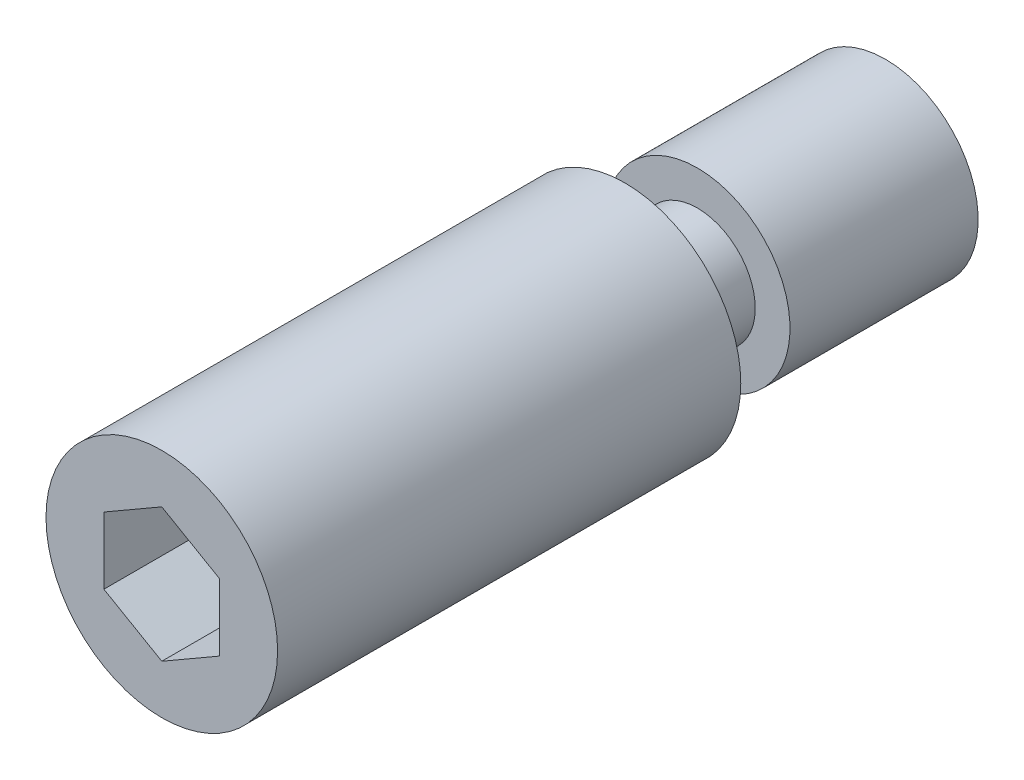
ISO-10303-21;
HEADER;
FILE_DESCRIPTION(('STEP AP214'),'2;1');
FILE_NAME('part.step','',(''),(''),'','','');
FILE_SCHEMA(('AUTOMOTIVE_DESIGN { 1 0 10303 214 1 1 1 1 }'));
ENDSEC;
DATA;
#1=APPLICATION_CONTEXT('core data for automotive mechanical design processes');
#2=APPLICATION_PROTOCOL_DEFINITION('international standard','automotive_design',2000,#1);
#3=PRODUCT_CONTEXT('',#1,'mechanical');
#4=PRODUCT('Part','Part','',(#3));
#5=PRODUCT_RELATED_PRODUCT_CATEGORY('part','',(#4));
#6=PRODUCT_DEFINITION_FORMATION('','',#4);
#7=PRODUCT_DEFINITION_CONTEXT('part definition',#1,'design');
#8=PRODUCT_DEFINITION('design','',#6,#7);
#9=PRODUCT_DEFINITION_SHAPE('','',#8);
#10=(LENGTH_UNIT() NAMED_UNIT(*) SI_UNIT(.MILLI.,.METRE.));
#11=(NAMED_UNIT(*) PLANE_ANGLE_UNIT() SI_UNIT($,.RADIAN.));
#12=(NAMED_UNIT(*) SI_UNIT($,.STERADIAN.) SOLID_ANGLE_UNIT());
#13=UNCERTAINTY_MEASURE_WITH_UNIT(LENGTH_MEASURE(1.E-05),#10,'distance_accuracy_value','');
#14=(GEOMETRIC_REPRESENTATION_CONTEXT(3) GLOBAL_UNCERTAINTY_ASSIGNED_CONTEXT((#13)) GLOBAL_UNIT_ASSIGNED_CONTEXT((#10,
#11,#12)) REPRESENTATION_CONTEXT('',''));
#15=CARTESIAN_POINT('',(0.,0.,0.));
#16=DIRECTION('',(0.,0.,1.));
#17=DIRECTION('',(1.,0.,0.));
#18=AXIS2_PLACEMENT_3D('',#15,#16,#17);
#19=CARTESIAN_POINT('',(0.,-4.,9.));
#20=DIRECTION('',(0.,0.,-1.));
#21=DIRECTION('',(0.,-1.,0.));
#22=AXIS2_PLACEMENT_3D('',#19,#20,#21);
#23=PLANE('',#22);
#24=CARTESIAN_POINT('',(0.,0.,9.));
#25=DIRECTION('',(0.,0.,1.));
#26=DIRECTION('',(0.,1.,0.));
#27=AXIS2_PLACEMENT_3D('',#24,#25,#26);
#28=CIRCLE('',#27,2.);
#29=CARTESIAN_POINT('',(0.,2.,9.));
#30=VERTEX_POINT('',#29);
#31=EDGE_CURVE('E115',#30,#30,#28,.T.);
#32=ORIENTED_EDGE('',*,*,#31,.T.);
#33=EDGE_LOOP('',(#32));
#34=FACE_BOUND('',#33,.T.);
#35=CARTESIAN_POINT('',(0.,0.,9.));
#36=DIRECTION('',(0.,0.,1.));
#37=DIRECTION('',(0.,1.,0.));
#38=AXIS2_PLACEMENT_3D('',#35,#36,#37);
#39=CIRCLE('',#38,4.);
#40=CARTESIAN_POINT('',(0.,4.,9.));
#41=VERTEX_POINT('',#40);
#42=EDGE_CURVE('E9',#41,#41,#39,.T.);
#43=ORIENTED_EDGE('',*,*,#42,.F.);
#44=EDGE_LOOP('',(#43));
#45=FACE_BOUND('',#44,.T.);
#46=ADVANCED_FACE('F14',(#34,#45),#23,.T.);
#47=CARTESIAN_POINT('',(0.,0.,20.));
#48=DIRECTION('',(0.,0.,1.));
#49=DIRECTION('',(0.,1.,0.));
#50=AXIS2_PLACEMENT_3D('',#47,#48,#49);
#51=CYLINDRICAL_SURFACE('',#50,4.);
#52=CARTESIAN_POINT('',(0.,0.,25.));
#53=DIRECTION('',(0.,0.,1.));
#54=DIRECTION('',(0.,1.,0.));
#55=AXIS2_PLACEMENT_3D('',#52,#53,#54);
#56=CIRCLE('',#55,4.);
#57=CARTESIAN_POINT('',(0.,4.,25.));
#58=VERTEX_POINT('',#57);
#59=EDGE_CURVE('E21',#58,#58,#56,.T.);
#60=ORIENTED_EDGE('',*,*,#59,.F.);
#61=EDGE_LOOP('',(#60));
#62=FACE_BOUND('',#61,.T.);
#63=ORIENTED_EDGE('',*,*,#42,.T.);
#64=EDGE_LOOP('',(#63));
#65=FACE_BOUND('',#64,.T.);
#66=ADVANCED_FACE('F136',(#62,#65),#51,.T.);
#67=CARTESIAN_POINT('',(0.,-4.,25.));
#68=DIRECTION('',(0.,0.,-1.));
#69=DIRECTION('',(0.,-1.,0.));
#70=AXIS2_PLACEMENT_3D('',#67,#68,#69);
#71=PLANE('',#70);
#72=DIRECTION('',(-0.866025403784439,-0.5,0.));
#73=VECTOR('',#72,1.);
#74=CARTESIAN_POINT('',(0.,2.30940107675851,25.));
#75=LINE('',#74,#73);
#76=CARTESIAN_POINT('',(0.,2.30940107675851,25.));
#77=VERTEX_POINT('',#76);
#78=CARTESIAN_POINT('',(-2.,1.15470053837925,25.));
#79=VERTEX_POINT('',#78);
#80=EDGE_CURVE('E102',#77,#79,#75,.T.);
#81=ORIENTED_EDGE('',*,*,#80,.F.);
#82=DIRECTION('',(-0.866025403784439,0.5,0.));
#83=VECTOR('',#82,1.);
#84=CARTESIAN_POINT('',(2.,1.15470053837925,25.));
#85=LINE('',#84,#83);
#86=CARTESIAN_POINT('',(2.,1.15470053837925,25.));
#87=VERTEX_POINT('',#86);
#88=EDGE_CURVE('E28',#87,#77,#85,.T.);
#89=ORIENTED_EDGE('',*,*,#88,.F.);
#90=DIRECTION('',(0.,1.,0.));
#91=VECTOR('',#90,1.);
#92=CARTESIAN_POINT('',(2.,-1.15470053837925,25.));
#93=LINE('',#92,#91);
#94=CARTESIAN_POINT('',(2.,-1.15470053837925,25.));
#95=VERTEX_POINT('',#94);
#96=EDGE_CURVE('E111',#95,#87,#93,.T.);
#97=ORIENTED_EDGE('',*,*,#96,.F.);
#98=DIRECTION('',(0.866025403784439,0.5,0.));
#99=VECTOR('',#98,1.);
#100=CARTESIAN_POINT('',(0.,-2.30940107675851,25.));
#101=LINE('',#100,#99);
#102=CARTESIAN_POINT('',(0.,-2.30940107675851,25.));
#103=VERTEX_POINT('',#102);
#104=EDGE_CURVE('E109',#103,#95,#101,.T.);
#105=ORIENTED_EDGE('',*,*,#104,.F.);
#106=DIRECTION('',(0.866025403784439,-0.5,0.));
#107=VECTOR('',#106,1.);
#108=CARTESIAN_POINT('',(-2.,-1.15470053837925,25.));
#109=LINE('',#108,#107);
#110=CARTESIAN_POINT('',(-2.,-1.15470053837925,25.));
#111=VERTEX_POINT('',#110);
#112=EDGE_CURVE('E76',#111,#103,#109,.T.);
#113=ORIENTED_EDGE('',*,*,#112,.F.);
#114=DIRECTION('',(0.,-1.,0.));
#115=VECTOR('',#114,1.);
#116=CARTESIAN_POINT('',(-2.,1.15470053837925,25.));
#117=LINE('',#116,#115);
#118=EDGE_CURVE('E105',#79,#111,#117,.T.);
#119=ORIENTED_EDGE('',*,*,#118,.F.);
#120=EDGE_LOOP('',(#81,#89,#97,#105,#113,#119));
#121=FACE_BOUND('',#120,.T.);
#122=ORIENTED_EDGE('',*,*,#59,.T.);
#123=EDGE_LOOP('',(#122));
#124=FACE_BOUND('',#123,.T.);
#125=ADVANCED_FACE('F134',(#121,#124),#71,.F.);
#126=CARTESIAN_POINT('',(0.,-3.2,0.));
#127=DIRECTION('',(0.,0.,-1.));
#128=DIRECTION('',(0.,-1.,0.));
#129=AXIS2_PLACEMENT_3D('',#126,#127,#128);
#130=PLANE('',#129);
#131=CARTESIAN_POINT('',(0.,0.,0.));
#132=DIRECTION('',(0.,0.,1.));
#133=DIRECTION('',(0.,1.,0.));
#134=AXIS2_PLACEMENT_3D('',#131,#132,#133);
#135=CIRCLE('',#134,3.2);
#136=CARTESIAN_POINT('',(0.,3.2,0.));
#137=VERTEX_POINT('',#136);
#138=EDGE_CURVE('E129',#137,#137,#135,.T.);
#139=ORIENTED_EDGE('',*,*,#138,.F.);
#140=EDGE_LOOP('',(#139));
#141=FACE_BOUND('',#140,.T.);
#142=ADVANCED_FACE('F167',(#141),#130,.T.);
#143=CARTESIAN_POINT('',(0.,0.,20.));
#144=DIRECTION('',(0.,0.,1.));
#145=DIRECTION('',(0.,1.,0.));
#146=AXIS2_PLACEMENT_3D('',#143,#144,#145);
#147=CYLINDRICAL_SURFACE('',#146,3.2);
#148=ORIENTED_EDGE('',*,*,#138,.T.);
#149=EDGE_LOOP('',(#148));
#150=FACE_BOUND('',#149,.T.);
#151=CARTESIAN_POINT('',(0.,0.,6.5));
#152=DIRECTION('',(0.,0.,1.));
#153=DIRECTION('',(0.,1.,0.));
#154=AXIS2_PLACEMENT_3D('',#151,#152,#153);
#155=CIRCLE('',#154,3.2);
#156=CARTESIAN_POINT('',(0.,3.2,6.5));
#157=VERTEX_POINT('',#156);
#158=EDGE_CURVE('E126',#157,#157,#155,.T.);
#159=ORIENTED_EDGE('',*,*,#158,.F.);
#160=EDGE_LOOP('',(#159));
#161=FACE_BOUND('',#160,.T.);
#162=ADVANCED_FACE('F160',(#150,#161),#147,.T.);
#163=CARTESIAN_POINT('',(0.,-2.,6.5));
#164=DIRECTION('',(0.,0.,1.));
#165=DIRECTION('',(0.,1.,0.));
#166=AXIS2_PLACEMENT_3D('',#163,#164,#165);
#167=PLANE('',#166);
#168=ORIENTED_EDGE('',*,*,#158,.T.);
#169=EDGE_LOOP('',(#168));
#170=FACE_BOUND('',#169,.T.);
#171=CARTESIAN_POINT('',(0.,0.,6.5));
#172=DIRECTION('',(0.,0.,1.));
#173=DIRECTION('',(0.,1.,0.));
#174=AXIS2_PLACEMENT_3D('',#171,#172,#173);
#175=CIRCLE('',#174,2.);
#176=CARTESIAN_POINT('',(0.,2.,6.5));
#177=VERTEX_POINT('',#176);
#178=EDGE_CURVE('E123',#177,#177,#175,.T.);
#179=ORIENTED_EDGE('',*,*,#178,.F.);
#180=EDGE_LOOP('',(#179));
#181=FACE_BOUND('',#180,.T.);
#182=ADVANCED_FACE('F151',(#170,#181),#167,.T.);
#183=CARTESIAN_POINT('',(0.,0.,20.));
#184=DIRECTION('',(0.,0.,1.));
#185=DIRECTION('',(0.,1.,0.));
#186=AXIS2_PLACEMENT_3D('',#183,#184,#185);
#187=CYLINDRICAL_SURFACE('',#186,2.);
#188=ORIENTED_EDGE('',*,*,#178,.T.);
#189=EDGE_LOOP('',(#188));
#190=FACE_BOUND('',#189,.T.);
#191=ORIENTED_EDGE('',*,*,#31,.F.);
#192=EDGE_LOOP('',(#191));
#193=FACE_BOUND('',#192,.T.);
#194=ADVANCED_FACE('F148',(#190,#193),#187,.T.);
#195=CARTESIAN_POINT('',(2.,1.15470053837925,20.));
#196=DIRECTION('',(0.5,0.866025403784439,0.));
#197=DIRECTION('',(-0.866025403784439,0.5,0.));
#198=AXIS2_PLACEMENT_3D('',#195,#196,#197);
#199=PLANE('',#198);
#200=ORIENTED_EDGE('',*,*,#88,.T.);
#201=DIRECTION('',(0.,0.,1.));
#202=VECTOR('',#201,1.);
#203=CARTESIAN_POINT('',(0.,2.30940107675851,20.));
#204=LINE('',#203,#202);
#205=CARTESIAN_POINT('',(0.,2.30940107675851,20.));
#206=VERTEX_POINT('',#205);
#207=EDGE_CURVE('E58',#206,#77,#204,.T.);
#208=ORIENTED_EDGE('',*,*,#207,.F.);
#209=DIRECTION('',(-0.866025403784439,0.5,0.));
#210=VECTOR('',#209,1.);
#211=CARTESIAN_POINT('',(2.,1.15470053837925,20.));
#212=LINE('',#211,#210);
#213=CARTESIAN_POINT('',(2.,1.15470053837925,20.));
#214=VERTEX_POINT('',#213);
#215=EDGE_CURVE('E113',#214,#206,#212,.T.);
#216=ORIENTED_EDGE('',*,*,#215,.F.);
#217=DIRECTION('',(0.,0.,1.));
#218=VECTOR('',#217,1.);
#219=CARTESIAN_POINT('',(2.,1.15470053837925,20.));
#220=LINE('',#219,#218);
#221=EDGE_CURVE('E36',#214,#87,#220,.T.);
#222=ORIENTED_EDGE('',*,*,#221,.T.);
#223=EDGE_LOOP('',(#200,#208,#216,#222));
#224=FACE_BOUND('',#223,.T.);
#225=ADVANCED_FACE('F150',(#224),#199,.F.);
#226=CARTESIAN_POINT('',(2.,-1.15470053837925,20.));
#227=DIRECTION('',(1.,0.,0.));
#228=DIRECTION('',(0.,0.,-1.));
#229=AXIS2_PLACEMENT_3D('',#226,#227,#228);
#230=PLANE('',#229);
#231=ORIENTED_EDGE('',*,*,#96,.T.);
#232=ORIENTED_EDGE('',*,*,#221,.F.);
#233=DIRECTION('',(0.,1.,0.));
#234=VECTOR('',#233,1.);
#235=CARTESIAN_POINT('',(2.,-1.15470053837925,20.));
#236=LINE('',#235,#234);
#237=CARTESIAN_POINT('',(2.,-1.15470053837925,20.));
#238=VERTEX_POINT('',#237);
#239=EDGE_CURVE('E88',#238,#214,#236,.T.);
#240=ORIENTED_EDGE('',*,*,#239,.F.);
#241=DIRECTION('',(0.,0.,1.));
#242=VECTOR('',#241,1.);
#243=CARTESIAN_POINT('',(2.,-1.15470053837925,20.));
#244=LINE('',#243,#242);
#245=EDGE_CURVE('E80',#238,#95,#244,.T.);
#246=ORIENTED_EDGE('',*,*,#245,.T.);
#247=EDGE_LOOP('',(#231,#232,#240,#246));
#248=FACE_BOUND('',#247,.T.);
#249=ADVANCED_FACE('F158',(#248),#230,.F.);
#250=CARTESIAN_POINT('',(0.,-2.30940107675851,20.));
#251=DIRECTION('',(0.5,-0.866025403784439,0.));
#252=DIRECTION('',(0.866025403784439,0.5,0.));
#253=AXIS2_PLACEMENT_3D('',#250,#251,#252);
#254=PLANE('',#253);
#255=ORIENTED_EDGE('',*,*,#104,.T.);
#256=ORIENTED_EDGE('',*,*,#245,.F.);
#257=DIRECTION('',(0.866025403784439,0.5,0.));
#258=VECTOR('',#257,1.);
#259=CARTESIAN_POINT('',(0.,-2.30940107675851,20.));
#260=LINE('',#259,#258);
#261=CARTESIAN_POINT('',(0.,-2.30940107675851,20.));
#262=VERTEX_POINT('',#261);
#263=EDGE_CURVE('E84',#262,#238,#260,.T.);
#264=ORIENTED_EDGE('',*,*,#263,.F.);
#265=DIRECTION('',(0.,0.,1.));
#266=VECTOR('',#265,1.);
#267=CARTESIAN_POINT('',(0.,-2.30940107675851,20.));
#268=LINE('',#267,#266);
#269=EDGE_CURVE('E69',#262,#103,#268,.T.);
#270=ORIENTED_EDGE('',*,*,#269,.T.);
#271=EDGE_LOOP('',(#255,#256,#264,#270));
#272=FACE_BOUND('',#271,.T.);
#273=ADVANCED_FACE('F85',(#272),#254,.F.);
#274=CARTESIAN_POINT('',(-2.,-1.15470053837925,20.));
#275=DIRECTION('',(-0.5,-0.866025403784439,0.));
#276=DIRECTION('',(0.866025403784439,-0.5,0.));
#277=AXIS2_PLACEMENT_3D('',#274,#275,#276);
#278=PLANE('',#277);
#279=ORIENTED_EDGE('',*,*,#112,.T.);
#280=ORIENTED_EDGE('',*,*,#269,.F.);
#281=DIRECTION('',(0.866025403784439,-0.5,0.));
#282=VECTOR('',#281,1.);
#283=CARTESIAN_POINT('',(-2.,-1.15470053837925,20.));
#284=LINE('',#283,#282);
#285=CARTESIAN_POINT('',(-2.,-1.15470053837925,20.));
#286=VERTEX_POINT('',#285);
#287=EDGE_CURVE('E73',#286,#262,#284,.T.);
#288=ORIENTED_EDGE('',*,*,#287,.F.);
#289=DIRECTION('',(0.,0.,1.));
#290=VECTOR('',#289,1.);
#291=CARTESIAN_POINT('',(-2.,-1.15470053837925,20.));
#292=LINE('',#291,#290);
#293=EDGE_CURVE('E81',#286,#111,#292,.T.);
#294=ORIENTED_EDGE('',*,*,#293,.T.);
#295=EDGE_LOOP('',(#279,#280,#288,#294));
#296=FACE_BOUND('',#295,.T.);
#297=ADVANCED_FACE('F71',(#296),#278,.F.);
#298=CARTESIAN_POINT('',(-2.,1.15470053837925,20.));
#299=DIRECTION('',(-1.,0.,0.));
#300=DIRECTION('',(0.,-1.,0.));
#301=AXIS2_PLACEMENT_3D('',#298,#299,#300);
#302=PLANE('',#301);
#303=ORIENTED_EDGE('',*,*,#118,.T.);
#304=ORIENTED_EDGE('',*,*,#293,.F.);
#305=DIRECTION('',(0.,-1.,0.));
#306=VECTOR('',#305,1.);
#307=CARTESIAN_POINT('',(-2.,1.15470053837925,20.));
#308=LINE('',#307,#306);
#309=CARTESIAN_POINT('',(-2.,1.15470053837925,20.));
#310=VERTEX_POINT('',#309);
#311=EDGE_CURVE('E94',#310,#286,#308,.T.);
#312=ORIENTED_EDGE('',*,*,#311,.F.);
#313=DIRECTION('',(0.,0.,1.));
#314=VECTOR('',#313,1.);
#315=CARTESIAN_POINT('',(-2.,1.15470053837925,20.));
#316=LINE('',#315,#314);
#317=EDGE_CURVE('E118',#310,#79,#316,.T.);
#318=ORIENTED_EDGE('',*,*,#317,.T.);
#319=EDGE_LOOP('',(#303,#304,#312,#318));
#320=FACE_BOUND('',#319,.T.);
#321=ADVANCED_FACE('F192',(#320),#302,.F.);
#322=CARTESIAN_POINT('',(0.,2.30940107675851,20.));
#323=DIRECTION('',(-0.5,0.866025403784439,0.));
#324=DIRECTION('',(-0.866025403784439,-0.5,0.));
#325=AXIS2_PLACEMENT_3D('',#322,#323,#324);
#326=PLANE('',#325);
#327=ORIENTED_EDGE('',*,*,#80,.T.);
#328=ORIENTED_EDGE('',*,*,#317,.F.);
#329=DIRECTION('',(-0.866025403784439,-0.5,0.));
#330=VECTOR('',#329,1.);
#331=CARTESIAN_POINT('',(0.,2.30940107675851,20.));
#332=LINE('',#331,#330);
#333=EDGE_CURVE('E96',#206,#310,#332,.T.);
#334=ORIENTED_EDGE('',*,*,#333,.F.);
#335=ORIENTED_EDGE('',*,*,#207,.T.);
#336=EDGE_LOOP('',(#327,#328,#334,#335));
#337=FACE_BOUND('',#336,.T.);
#338=ADVANCED_FACE('F180',(#337),#326,.F.);
#339=CARTESIAN_POINT('',(0.,2.30940107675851,20.));
#340=DIRECTION('',(0.,0.,1.));
#341=DIRECTION('',(1.,0.,0.));
#342=AXIS2_PLACEMENT_3D('',#339,#340,#341);
#343=PLANE('',#342);
#344=ORIENTED_EDGE('',*,*,#215,.T.);
#345=ORIENTED_EDGE('',*,*,#333,.T.);
#346=ORIENTED_EDGE('',*,*,#311,.T.);
#347=ORIENTED_EDGE('',*,*,#287,.T.);
#348=ORIENTED_EDGE('',*,*,#263,.T.);
#349=ORIENTED_EDGE('',*,*,#239,.T.);
#350=EDGE_LOOP('',(#344,#345,#346,#347,#348,#349));
#351=FACE_BOUND('',#350,.T.);
#352=ADVANCED_FACE('F91',(#351),#343,.T.);
#353=CLOSED_SHELL('',(#46,#66,#125,#142,#162,#182,#194,#225,#249,#273,#297,#321,#338,#352));
#354=MANIFOLD_SOLID_BREP('B1',#353);
#355=ADVANCED_BREP_SHAPE_REPRESENTATION('',(#18,#354),#14);
#356=SHAPE_DEFINITION_REPRESENTATION(#9,#355);
ENDSEC;
END-ISO-10303-21;
